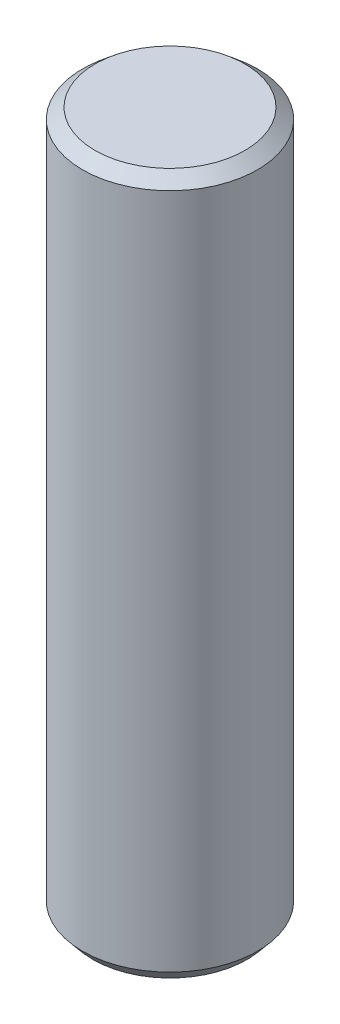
ISO-10303-21;
HEADER;
FILE_DESCRIPTION(('STEP AP214'),'2;1');
FILE_NAME('part.step','',(''),(''),'','','');
FILE_SCHEMA(('AUTOMOTIVE_DESIGN { 1 0 10303 214 1 1 1 1 }'));
ENDSEC;
DATA;
#1=APPLICATION_CONTEXT('core data for automotive mechanical design processes');
#2=APPLICATION_PROTOCOL_DEFINITION('international standard','automotive_design',2000,#1);
#3=PRODUCT_CONTEXT('',#1,'mechanical');
#4=PRODUCT('Part','Part','',(#3));
#5=PRODUCT_RELATED_PRODUCT_CATEGORY('part','',(#4));
#6=PRODUCT_DEFINITION_FORMATION('','',#4);
#7=PRODUCT_DEFINITION_CONTEXT('part definition',#1,'design');
#8=PRODUCT_DEFINITION('design','',#6,#7);
#9=PRODUCT_DEFINITION_SHAPE('','',#8);
#10=(LENGTH_UNIT() NAMED_UNIT(*) SI_UNIT(.MILLI.,.METRE.));
#11=(NAMED_UNIT(*) PLANE_ANGLE_UNIT() SI_UNIT($,.RADIAN.));
#12=(NAMED_UNIT(*) SI_UNIT($,.STERADIAN.) SOLID_ANGLE_UNIT());
#13=UNCERTAINTY_MEASURE_WITH_UNIT(LENGTH_MEASURE(1.E-05),#10,'distance_accuracy_value','');
#14=(GEOMETRIC_REPRESENTATION_CONTEXT(3) GLOBAL_UNCERTAINTY_ASSIGNED_CONTEXT((#13)) GLOBAL_UNIT_ASSIGNED_CONTEXT((#10,
#11,#12)) REPRESENTATION_CONTEXT('',''));
#15=CARTESIAN_POINT('',(0.,0.,0.));
#16=DIRECTION('',(0.,0.,1.));
#17=DIRECTION('',(1.,0.,0.));
#18=AXIS2_PLACEMENT_3D('',#15,#16,#17);
#19=CARTESIAN_POINT('',(0.,10.,0.));
#20=DIRECTION('',(0.,-1.,0.));
#21=DIRECTION('',(0.,0.,-1.));
#22=AXIS2_PLACEMENT_3D('',#19,#20,#21);
#23=CYLINDRICAL_SURFACE('',#22,2.5);
#24=CARTESIAN_POINT('',(0.,-9.64247392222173,0.));
#25=DIRECTION('',(0.,1.,0.));
#26=DIRECTION('',(0.,0.,1.));
#27=AXIS2_PLACEMENT_3D('',#24,#25,#26);
#28=CIRCLE('',#27,2.5);
#29=CARTESIAN_POINT('',(0.,-9.64247392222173,2.50000000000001));
#30=VERTEX_POINT('',#29);
#31=EDGE_CURVE('E46',#30,#30,#28,.T.);
#32=ORIENTED_EDGE('',*,*,#31,.T.);
#33=EDGE_LOOP('',(#32));
#34=FACE_BOUND('',#33,.T.);
#35=CARTESIAN_POINT('',(0.,9.69999999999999,0.));
#36=DIRECTION('',(0.,1.,0.));
#37=DIRECTION('',(0.,0.,1.));
#38=AXIS2_PLACEMENT_3D('',#35,#36,#37);
#39=CIRCLE('',#38,2.5);
#40=CARTESIAN_POINT('',(0.,9.69999999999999,2.50000000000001));
#41=VERTEX_POINT('',#40);
#42=EDGE_CURVE('E50',#41,#41,#39,.F.);
#43=ORIENTED_EDGE('',*,*,#42,.T.);
#44=EDGE_LOOP('',(#43));
#45=FACE_BOUND('',#44,.T.);
#46=ADVANCED_FACE('F35',(#34,#45),#23,.T.);
#47=CARTESIAN_POINT('',(0.,10.,0.));
#48=DIRECTION('',(0.,1.,0.));
#49=DIRECTION('',(0.,0.,1.));
#50=AXIS2_PLACEMENT_3D('',#47,#48,#49);
#51=PLANE('',#50);
#52=CARTESIAN_POINT('',(0.,10.,0.));
#53=DIRECTION('',(0.,1.,0.));
#54=DIRECTION('',(0.,0.,1.));
#55=AXIS2_PLACEMENT_3D('',#52,#53,#54);
#56=CIRCLE('',#55,2.14247392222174);
#57=CARTESIAN_POINT('',(0.,10.,2.14247392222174));
#58=VERTEX_POINT('',#57);
#59=EDGE_CURVE('E10',#58,#58,#56,.T.);
#60=ORIENTED_EDGE('',*,*,#59,.T.);
#61=EDGE_LOOP('',(#60));
#62=FACE_BOUND('',#61,.T.);
#63=ADVANCED_FACE('F66',(#62),#51,.T.);
#64=CARTESIAN_POINT('',(0.,-10.,0.));
#65=DIRECTION('',(0.,1.,0.));
#66=DIRECTION('',(0.,0.,1.));
#67=AXIS2_PLACEMENT_3D('',#64,#65,#66);
#68=PLANE('',#67);
#69=CARTESIAN_POINT('',(0.,-10.,0.));
#70=DIRECTION('',(0.,1.,0.));
#71=DIRECTION('',(0.,0.,1.));
#72=AXIS2_PLACEMENT_3D('',#69,#70,#71);
#73=CIRCLE('',#72,2.2);
#74=CARTESIAN_POINT('',(0.,-10.,2.19999999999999));
#75=VERTEX_POINT('',#74);
#76=EDGE_CURVE('E42',#75,#75,#73,.F.);
#77=ORIENTED_EDGE('',*,*,#76,.T.);
#78=EDGE_LOOP('',(#77));
#79=FACE_BOUND('',#78,.T.);
#80=ADVANCED_FACE('F63',(#79),#68,.F.);
#81=CARTESIAN_POINT('',(0.,-9.64247392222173,0.));
#82=DIRECTION('',(0.,1.,0.));
#83=DIRECTION('',(0.,0.,1.));
#84=AXIS2_PLACEMENT_3D('',#81,#82,#83);
#85=CONICAL_SURFACE('',#84,2.5,0.698131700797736);
#86=CARTESIAN_POINT('',(0.,-10.,2.19999999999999));
#87=CARTESIAN_POINT('',(0.,-9.99627577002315,2.20312499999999));
#88=CARTESIAN_POINT('',(0.,-9.9925515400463,2.20624999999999));
#89=CARTESIAN_POINT('',(0.,-9.98510308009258,2.21249999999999));
#90=CARTESIAN_POINT('',(0.,-9.98137885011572,2.21562499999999));
#91=CARTESIAN_POINT('',(0.,-9.97393039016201,2.22187499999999));
#92=CARTESIAN_POINT('',(0.,-9.97020616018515,2.22499999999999));
#93=CARTESIAN_POINT('',(0.,-9.96275770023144,2.23124999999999));
#94=CARTESIAN_POINT('',(0.,-9.95903347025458,2.23437499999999));
#95=CARTESIAN_POINT('',(0.,-9.95158501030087,2.24062499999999));
#96=CARTESIAN_POINT('',(0.,-9.94786078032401,2.24374999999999));
#97=CARTESIAN_POINT('',(0.,-9.9404123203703,2.24999999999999));
#98=CARTESIAN_POINT('',(0.,-9.93668809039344,2.25312499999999));
#99=CARTESIAN_POINT('',(0.,-9.92923963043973,2.25937499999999));
#100=CARTESIAN_POINT('',(0.,-9.92551540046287,2.26249999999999));
#101=CARTESIAN_POINT('',(0.,-9.91806694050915,2.26874999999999));
#102=CARTESIAN_POINT('',(0.,-9.9143427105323,2.27187499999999));
#103=CARTESIAN_POINT('',(0.,-9.90689425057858,2.27812499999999));
#104=CARTESIAN_POINT('',(0.,-9.90317002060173,2.28124999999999));
#105=CARTESIAN_POINT('',(0.,-9.89572156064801,2.28749999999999));
#106=CARTESIAN_POINT('',(0.,-9.89199733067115,2.29062499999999));
#107=CARTESIAN_POINT('',(0.,-9.88454887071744,2.29687499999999));
#108=CARTESIAN_POINT('',(0.,-9.88082464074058,2.3));
#109=CARTESIAN_POINT('',(0.,-9.87337618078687,2.30625));
#110=CARTESIAN_POINT('',(0.,-9.86965195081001,2.309375));
#111=CARTESIAN_POINT('',(0.,-9.8622034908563,2.315625));
#112=CARTESIAN_POINT('',(0.,-9.85847926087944,2.31875));
#113=CARTESIAN_POINT('',(0.,-9.85103080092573,2.325));
#114=CARTESIAN_POINT('',(0.,-9.84730657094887,2.328125));
#115=CARTESIAN_POINT('',(0.,-9.83985811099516,2.334375));
#116=CARTESIAN_POINT('',(0.,-9.8361338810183,2.3375));
#117=CARTESIAN_POINT('',(0.,-9.82868542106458,2.34375));
#118=CARTESIAN_POINT('',(0.,-9.82496119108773,2.346875));
#119=CARTESIAN_POINT('',(0.,-9.81751273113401,2.353125));
#120=CARTESIAN_POINT('',(0.,-9.81378850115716,2.35625));
#121=CARTESIAN_POINT('',(0.,-9.80634004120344,2.3625));
#122=CARTESIAN_POINT('',(0.,-9.80261581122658,2.365625));
#123=CARTESIAN_POINT('',(0.,-9.79516735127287,2.371875));
#124=CARTESIAN_POINT('',(0.,-9.79144312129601,2.375));
#125=CARTESIAN_POINT('',(0.,-9.7839946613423,2.38125));
#126=CARTESIAN_POINT('',(0.,-9.78027043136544,2.384375));
#127=CARTESIAN_POINT('',(0.,-9.77282197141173,2.390625));
#128=CARTESIAN_POINT('',(0.,-9.76909774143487,2.39375));
#129=CARTESIAN_POINT('',(0.,-9.76164928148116,2.4));
#130=CARTESIAN_POINT('',(0.,-9.7579250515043,2.403125));
#131=CARTESIAN_POINT('',(0.,-9.75047659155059,2.409375));
#132=CARTESIAN_POINT('',(0.,-9.74675236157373,2.4125));
#133=CARTESIAN_POINT('',(0.,-9.73930390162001,2.41875));
#134=CARTESIAN_POINT('',(0.,-9.73557967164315,2.421875));
#135=CARTESIAN_POINT('',(0.,-9.72813121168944,2.428125));
#136=CARTESIAN_POINT('',(0.,-9.72440698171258,2.43125));
#137=CARTESIAN_POINT('',(0.,-9.71695852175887,2.4375));
#138=CARTESIAN_POINT('',(0.,-9.71323429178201,2.440625));
#139=CARTESIAN_POINT('',(0.,-9.7057858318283,2.446875));
#140=CARTESIAN_POINT('',(0.,-9.70206160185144,2.45));
#141=CARTESIAN_POINT('',(0.,-9.69461314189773,2.45625));
#142=CARTESIAN_POINT('',(0.,-9.69088891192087,2.459375));
#143=CARTESIAN_POINT('',(0.,-9.68344045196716,2.46562500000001));
#144=CARTESIAN_POINT('',(0.,-9.6797162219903,2.46875000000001));
#145=CARTESIAN_POINT('',(0.,-9.67226776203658,2.47500000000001));
#146=CARTESIAN_POINT('',(0.,-9.66854353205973,2.47812500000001));
#147=CARTESIAN_POINT('',(0.,-9.66109507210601,2.48437500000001));
#148=CARTESIAN_POINT('',(0.,-9.65737084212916,2.48750000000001));
#149=CARTESIAN_POINT('',(0.,-9.64992238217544,2.49375000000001));
#150=CARTESIAN_POINT('',(0.,-9.64619815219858,2.49687500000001));
#151=CARTESIAN_POINT('',(0.,-9.64247392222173,2.50000000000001));
#152=B_SPLINE_CURVE_WITH_KNOTS('',3,(#86,#87,#88,#89,#90,#91,#92,#93,#94,#95,#96,#97,#98,#99,
#100,#101,#102,#103,#104,#105,#106,#107,#108,#109,#110,#111,#112,#113,#114,#115,#116,#117,#118,
#119,#120,#121,#122,#123,#124,#125,#126,#127,#128,#129,#130,#131,#132,#133,#134,#135,#136,#137,
#138,#139,#140,#141,#142,#143,#144,#145,#146,#147,#148,#149,#150,#151),.UNSPECIFIED.,.F.,.F.,(4,
2,2,2,2,2,2,2,2,2,2,2,2,2,2,2,2,2,2,2,2,2,2,2,2,2,2,2,2,2,2,2,4),(0.,0.0145849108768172,
0.0291698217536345,0.0437547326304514,0.0583396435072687,0.0729245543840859,0.0875094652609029,
0.10209437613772,0.116679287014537,0.131264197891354,0.145849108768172,0.160434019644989,
0.175018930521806,0.189603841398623,0.204188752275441,0.218773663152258,0.233358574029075,
0.247943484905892,0.262528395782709,0.277113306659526,0.291698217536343,0.306283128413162,
0.320868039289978,0.335452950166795,0.350037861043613,0.36462277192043,0.379207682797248,
0.393792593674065,0.408377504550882,0.422962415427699,0.437547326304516,0.452132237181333,
0.46671714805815),.UNSPECIFIED.);
#153=EDGE_CURVE('BSEAM59',#75,#30,#152,.T.);
#154=ORIENTED_EDGE('',*,*,#76,.F.);
#155=ORIENTED_EDGE('',*,*,#31,.F.);
#156=ORIENTED_EDGE('',*,*,#153,.T.);
#157=ORIENTED_EDGE('',*,*,#153,.F.);
#158=EDGE_LOOP('',(#154,#156,#155,#157));
#159=FACE_BOUND('',#158,.T.);
#160=ADVANCED_FACE('F59',(#159),#85,.T.);
#161=CARTESIAN_POINT('',(0.,10.,0.));
#162=DIRECTION('',(0.,-1.,0.));
#163=DIRECTION('',(0.,0.,-1.));
#164=AXIS2_PLACEMENT_3D('',#161,#162,#163);
#165=CONICAL_SURFACE('',#164,2.14247392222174,0.872664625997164);
#166=ORIENTED_EDGE('',*,*,#42,.F.);
#167=EDGE_LOOP('',(#166));
#168=FACE_BOUND('',#167,.T.);
#169=ORIENTED_EDGE('',*,*,#59,.F.);
#170=EDGE_LOOP('',(#169));
#171=FACE_BOUND('',#170,.T.);
#172=ADVANCED_FACE('F37',(#168,#171),#165,.T.);
#173=CLOSED_SHELL('',(#46,#63,#80,#160,#172));
#174=MANIFOLD_SOLID_BREP('B2',#173);
#175=ADVANCED_BREP_SHAPE_REPRESENTATION('',(#18,#174),#14);
#176=SHAPE_DEFINITION_REPRESENTATION(#9,#175);
ENDSEC;
END-ISO-10303-21;
